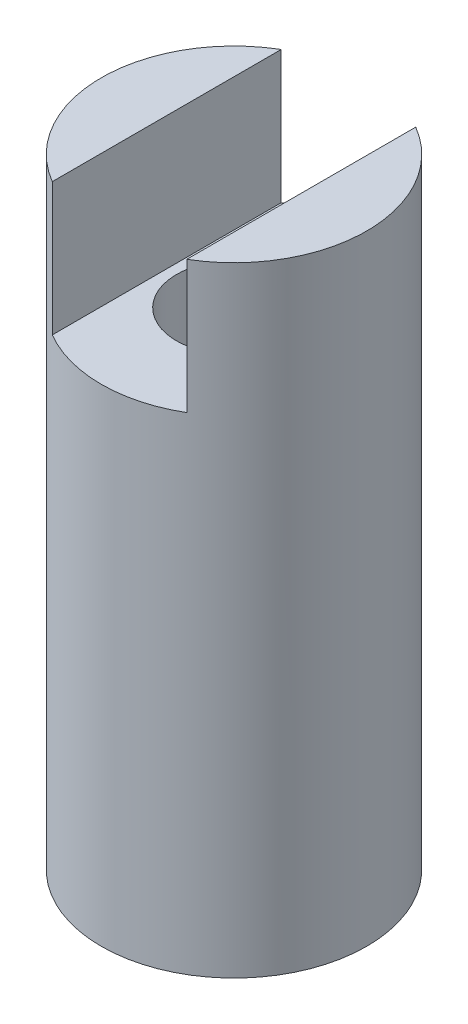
ISO-10303-21;
HEADER;
FILE_DESCRIPTION(('STEP AP214'),'2;1');
FILE_NAME('part.step','',(''),(''),'','','');
FILE_SCHEMA(('AUTOMOTIVE_DESIGN { 1 0 10303 214 1 1 1 1 }'));
ENDSEC;
DATA;
#1=APPLICATION_CONTEXT('core data for automotive mechanical design processes');
#2=APPLICATION_PROTOCOL_DEFINITION('international standard','automotive_design',2000,#1);
#3=PRODUCT_CONTEXT('',#1,'mechanical');
#4=PRODUCT('Part','Part','',(#3));
#5=PRODUCT_RELATED_PRODUCT_CATEGORY('part','',(#4));
#6=PRODUCT_DEFINITION_FORMATION('','',#4);
#7=PRODUCT_DEFINITION_CONTEXT('part definition',#1,'design');
#8=PRODUCT_DEFINITION('design','',#6,#7);
#9=PRODUCT_DEFINITION_SHAPE('','',#8);
#10=(LENGTH_UNIT() NAMED_UNIT(*) SI_UNIT(.MILLI.,.METRE.));
#11=(NAMED_UNIT(*) PLANE_ANGLE_UNIT() SI_UNIT($,.RADIAN.));
#12=(NAMED_UNIT(*) SI_UNIT($,.STERADIAN.) SOLID_ANGLE_UNIT());
#13=UNCERTAINTY_MEASURE_WITH_UNIT(LENGTH_MEASURE(1.E-05),#10,'distance_accuracy_value','');
#14=(GEOMETRIC_REPRESENTATION_CONTEXT(3) GLOBAL_UNCERTAINTY_ASSIGNED_CONTEXT((#13)) GLOBAL_UNIT_ASSIGNED_CONTEXT((#10,
#11,#12)) REPRESENTATION_CONTEXT('',''));
#15=CARTESIAN_POINT('',(0.,0.,0.));
#16=DIRECTION('',(0.,0.,1.));
#17=DIRECTION('',(1.,0.,0.));
#18=AXIS2_PLACEMENT_3D('',#15,#16,#17);
#19=CARTESIAN_POINT('',(-15.,70.0000000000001,-1.66533453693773E-13));
#20=DIRECTION('',(0.,-1.,0.));
#21=DIRECTION('',(0.,0.,-1.));
#22=AXIS2_PLACEMENT_3D('',#19,#20,#21);
#23=PLANE('',#22);
#24=DIRECTION('',(0.,0.,-1.));
#25=VECTOR('',#24,1.);
#26=CARTESIAN_POINT('',(7.59999999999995,70.0000000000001,0.));
#27=LINE('',#26,#25);
#28=CARTESIAN_POINT('',(7.59999999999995,70.0000000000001,12.9321305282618));
#29=VERTEX_POINT('',#28);
#30=CARTESIAN_POINT('',(7.59999999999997,70.0000000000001,-12.9321305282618));
#31=VERTEX_POINT('',#30);
#32=EDGE_CURVE('E49',#29,#31,#27,.T.);
#33=ORIENTED_EDGE('',*,*,#32,.F.);
#34=CARTESIAN_POINT('',(0.,70.0000000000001,-1.66533453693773E-13));
#35=DIRECTION('',(0.,-1.,0.));
#36=DIRECTION('',(0.,0.,-1.));
#37=AXIS2_PLACEMENT_3D('',#34,#35,#36);
#38=CIRCLE('',#37,15.);
#39=EDGE_CURVE('E102',#31,#29,#38,.T.);
#40=ORIENTED_EDGE('',*,*,#39,.F.);
#41=EDGE_LOOP('',(#33,#40));
#42=FACE_BOUND('',#41,.T.);
#43=ADVANCED_FACE('F40',(#42),#23,.F.);
#44=CARTESIAN_POINT('',(0.,0.,-1.66533453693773E-13));
#45=DIRECTION('',(0.,-1.,0.));
#46=DIRECTION('',(0.,0.,-1.));
#47=AXIS2_PLACEMENT_3D('',#44,#45,#46);
#48=CYLINDRICAL_SURFACE('',#47,15.);
#49=CARTESIAN_POINT('',(0.,0.,-1.66533453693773E-13));
#50=DIRECTION('',(0.,-1.,0.));
#51=DIRECTION('',(0.,0.,-1.));
#52=AXIS2_PLACEMENT_3D('',#49,#50,#51);
#53=CIRCLE('',#52,15.);
#54=CARTESIAN_POINT('',(0.,0.,-15.0000000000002));
#55=VERTEX_POINT('',#54);
#56=EDGE_CURVE('E115',#55,#55,#53,.T.);
#57=ORIENTED_EDGE('',*,*,#56,.F.);
#58=EDGE_LOOP('',(#57));
#59=FACE_BOUND('',#58,.T.);
#60=CARTESIAN_POINT('',(-7.60000000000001,70.0000000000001,12.9321305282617));
#61=VERTEX_POINT('',#60);
#62=CARTESIAN_POINT('',(-7.60000000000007,70.0000000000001,-12.9321305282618));
#63=VERTEX_POINT('',#62);
#64=EDGE_CURVE('E130',#61,#63,#38,.T.);
#65=ORIENTED_EDGE('',*,*,#64,.T.);
#66=DIRECTION('',(0.,-1.,0.));
#67=VECTOR('',#66,1.);
#68=CARTESIAN_POINT('',(-7.60000000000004,0.,-12.9321305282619));
#69=LINE('',#68,#67);
#70=CARTESIAN_POINT('',(-7.60000000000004,54.9999999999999,-12.9321305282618));
#71=VERTEX_POINT('',#70);
#72=EDGE_CURVE('E64',#63,#71,#69,.T.);
#73=ORIENTED_EDGE('',*,*,#72,.T.);
#74=CARTESIAN_POINT('',(0.,54.9999999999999,-1.66533453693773E-13));
#75=DIRECTION('',(0.,-1.,0.));
#76=DIRECTION('',(0.,0.,-1.));
#77=AXIS2_PLACEMENT_3D('',#74,#75,#76);
#78=CIRCLE('',#77,15.);
#79=CARTESIAN_POINT('',(7.59999999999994,54.9999999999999,-12.9321305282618));
#80=VERTEX_POINT('',#79);
#81=EDGE_CURVE('E92',#71,#80,#78,.T.);
#82=ORIENTED_EDGE('',*,*,#81,.T.);
#83=DIRECTION('',(0.,-1.,0.));
#84=VECTOR('',#83,1.);
#85=CARTESIAN_POINT('',(7.59999999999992,0.,-12.9321305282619));
#86=LINE('',#85,#84);
#87=EDGE_CURVE('E96',#31,#80,#86,.T.);
#88=ORIENTED_EDGE('',*,*,#87,.F.);
#89=ORIENTED_EDGE('',*,*,#39,.T.);
#90=DIRECTION('',(0.,-1.,0.));
#91=VECTOR('',#90,1.);
#92=CARTESIAN_POINT('',(7.59999999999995,0.,12.9321305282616));
#93=LINE('',#92,#91);
#94=CARTESIAN_POINT('',(7.59999999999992,54.9999999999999,12.9321305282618));
#95=VERTEX_POINT('',#94);
#96=EDGE_CURVE('E56',#95,#29,#93,.F.);
#97=ORIENTED_EDGE('',*,*,#96,.F.);
#98=CARTESIAN_POINT('',(-7.60000000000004,54.9999999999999,12.9321305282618));
#99=VERTEX_POINT('',#98);
#100=EDGE_CURVE('E84',#95,#99,#78,.T.);
#101=ORIENTED_EDGE('',*,*,#100,.T.);
#102=DIRECTION('',(0.,-1.,0.));
#103=VECTOR('',#102,1.);
#104=CARTESIAN_POINT('',(-7.60000000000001,0.,12.9321305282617));
#105=LINE('',#104,#103);
#106=EDGE_CURVE('E108',#99,#61,#105,.F.);
#107=ORIENTED_EDGE('',*,*,#106,.T.);
#108=EDGE_LOOP('',(#65,#73,#82,#88,#89,#97,#101,#107));
#109=FACE_BOUND('',#108,.T.);
#110=ADVANCED_FACE('F42',(#59,#109),#48,.T.);
#111=ORIENTED_EDGE('',*,*,#64,.F.);
#112=DIRECTION('',(0.,0.,-1.));
#113=VECTOR('',#112,1.);
#114=CARTESIAN_POINT('',(-7.60000000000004,70.0000000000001,0.));
#115=LINE('',#114,#113);
#116=EDGE_CURVE('E11',#61,#63,#115,.T.);
#117=ORIENTED_EDGE('',*,*,#116,.T.);
#118=EDGE_LOOP('',(#111,#117));
#119=FACE_BOUND('',#118,.T.);
#120=ADVANCED_FACE('F139',(#119),#23,.F.);
#121=CARTESIAN_POINT('',(0.,0.,-1.66533453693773E-13));
#122=DIRECTION('',(0.,-1.,0.));
#123=DIRECTION('',(0.,0.,-1.));
#124=AXIS2_PLACEMENT_3D('',#121,#122,#123);
#125=CYLINDRICAL_SURFACE('',#124,6.5);
#126=CARTESIAN_POINT('',(0.,54.9999999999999,-1.66533453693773E-13));
#127=DIRECTION('',(0.,-1.,0.));
#128=DIRECTION('',(0.,0.,-1.));
#129=AXIS2_PLACEMENT_3D('',#126,#127,#128);
#130=CIRCLE('',#129,6.5);
#131=CARTESIAN_POINT('',(0.,54.9999999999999,-6.50000000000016));
#132=VERTEX_POINT('',#131);
#133=EDGE_CURVE('E133',#132,#132,#130,.F.);
#134=ORIENTED_EDGE('',*,*,#133,.T.);
#135=EDGE_LOOP('',(#134));
#136=FACE_BOUND('',#135,.T.);
#137=CARTESIAN_POINT('',(0.,44.9999999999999,-4.02455846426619E-13));
#138=DIRECTION('',(0.,-1.,0.));
#139=DIRECTION('',(0.,0.,-1.));
#140=AXIS2_PLACEMENT_3D('',#137,#138,#139);
#141=CIRCLE('',#140,6.5);
#142=CARTESIAN_POINT('',(0.,44.9999999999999,-6.5000000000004));
#143=VERTEX_POINT('',#142);
#144=EDGE_CURVE('E127',#143,#143,#141,.T.);
#145=ORIENTED_EDGE('',*,*,#144,.T.);
#146=EDGE_LOOP('',(#145));
#147=FACE_BOUND('',#146,.T.);
#148=ADVANCED_FACE('F146',(#136,#147),#125,.F.);
#149=CARTESIAN_POINT('',(0.,41.75,0.));
#150=DIRECTION('',(0.,1.,0.));
#151=DIRECTION('',(0.,0.,1.));
#152=AXIS2_PLACEMENT_3D('',#149,#150,#151);
#153=CONICAL_SURFACE('',#152,3.25,0.78539816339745);
#154=ORIENTED_EDGE('',*,*,#144,.F.);
#155=EDGE_LOOP('',(#154));
#156=FACE_BOUND('',#155,.T.);
#157=CARTESIAN_POINT('',(0.,41.75,0.));
#158=DIRECTION('',(0.,-1.,0.));
#159=DIRECTION('',(0.,0.,-1.));
#160=AXIS2_PLACEMENT_3D('',#157,#158,#159);
#161=CIRCLE('',#160,3.25);
#162=CARTESIAN_POINT('',(0.,41.75,-3.25));
#163=VERTEX_POINT('',#162);
#164=EDGE_CURVE('E123',#163,#163,#161,.T.);
#165=ORIENTED_EDGE('',*,*,#164,.T.);
#166=EDGE_LOOP('',(#165));
#167=FACE_BOUND('',#166,.T.);
#168=ADVANCED_FACE('F151',(#156,#167),#153,.F.);
#169=CARTESIAN_POINT('',(0.,0.,-1.66533453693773E-13));
#170=DIRECTION('',(0.,-1.,0.));
#171=DIRECTION('',(0.,0.,-1.));
#172=AXIS2_PLACEMENT_3D('',#169,#170,#171);
#173=CYLINDRICAL_SURFACE('',#172,3.25);
#174=ORIENTED_EDGE('',*,*,#164,.F.);
#175=EDGE_LOOP('',(#174));
#176=FACE_BOUND('',#175,.T.);
#177=CARTESIAN_POINT('',(0.,0.,-1.66533453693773E-13));
#178=DIRECTION('',(0.,-1.,0.));
#179=DIRECTION('',(0.,0.,-1.));
#180=AXIS2_PLACEMENT_3D('',#177,#178,#179);
#181=CIRCLE('',#180,3.25);
#182=CARTESIAN_POINT('',(0.,0.,-3.25000000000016));
#183=VERTEX_POINT('',#182);
#184=EDGE_CURVE('E119',#183,#183,#181,.T.);
#185=ORIENTED_EDGE('',*,*,#184,.T.);
#186=EDGE_LOOP('',(#185));
#187=FACE_BOUND('',#186,.T.);
#188=ADVANCED_FACE('F165',(#176,#187),#173,.F.);
#189=CARTESIAN_POINT('',(-3.25000000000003,0.,0.));
#190=DIRECTION('',(0.,1.,0.));
#191=DIRECTION('',(0.,0.,1.));
#192=AXIS2_PLACEMENT_3D('',#189,#190,#191);
#193=PLANE('',#192);
#194=ORIENTED_EDGE('',*,*,#184,.F.);
#195=EDGE_LOOP('',(#194));
#196=FACE_BOUND('',#195,.T.);
#197=ORIENTED_EDGE('',*,*,#56,.T.);
#198=EDGE_LOOP('',(#197));
#199=FACE_BOUND('',#198,.T.);
#200=ADVANCED_FACE('F158',(#196,#199),#193,.F.);
#201=CARTESIAN_POINT('',(-7.60000000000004,85.,24.9999999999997));
#202=DIRECTION('',(-1.,0.,0.));
#203=DIRECTION('',(0.,0.,1.));
#204=AXIS2_PLACEMENT_3D('',#201,#202,#203);
#205=PLANE('',#204);
#206=ORIENTED_EDGE('',*,*,#116,.F.);
#207=ORIENTED_EDGE('',*,*,#106,.F.);
#208=DIRECTION('',(0.,0.,-1.));
#209=VECTOR('',#208,1.);
#210=CARTESIAN_POINT('',(-7.60000000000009,54.9999999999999,24.9999999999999));
#211=LINE('',#210,#209);
#212=EDGE_CURVE('E88',#99,#71,#211,.T.);
#213=ORIENTED_EDGE('',*,*,#212,.T.);
#214=ORIENTED_EDGE('',*,*,#72,.F.);
#215=EDGE_LOOP('',(#206,#207,#213,#214));
#216=FACE_BOUND('',#215,.T.);
#217=ADVANCED_FACE('F156',(#216),#205,.F.);
#218=CARTESIAN_POINT('',(7.59999999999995,85.0000000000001,24.9999999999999));
#219=DIRECTION('',(-1.,0.,0.));
#220=DIRECTION('',(0.,0.,1.));
#221=AXIS2_PLACEMENT_3D('',#218,#219,#220);
#222=PLANE('',#221);
#223=ORIENTED_EDGE('',*,*,#87,.T.);
#224=DIRECTION('',(0.,0.,-1.));
#225=VECTOR('',#224,1.);
#226=CARTESIAN_POINT('',(7.59999999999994,54.9999999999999,25.));
#227=LINE('',#226,#225);
#228=EDGE_CURVE('E86',#95,#80,#227,.T.);
#229=ORIENTED_EDGE('',*,*,#228,.F.);
#230=ORIENTED_EDGE('',*,*,#96,.T.);
#231=ORIENTED_EDGE('',*,*,#32,.T.);
#232=EDGE_LOOP('',(#223,#229,#230,#231));
#233=FACE_BOUND('',#232,.T.);
#234=ADVANCED_FACE('F94',(#233),#222,.T.);
#235=CARTESIAN_POINT('',(-7.60000000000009,54.9999999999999,24.9999999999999));
#236=DIRECTION('',(0.,-1.,0.));
#237=DIRECTION('',(0.,0.,-1.));
#238=AXIS2_PLACEMENT_3D('',#235,#236,#237);
#239=PLANE('',#238);
#240=ORIENTED_EDGE('',*,*,#133,.F.);
#241=EDGE_LOOP('',(#240));
#242=FACE_BOUND('',#241,.T.);
#243=ORIENTED_EDGE('',*,*,#228,.T.);
#244=ORIENTED_EDGE('',*,*,#81,.F.);
#245=ORIENTED_EDGE('',*,*,#212,.F.);
#246=ORIENTED_EDGE('',*,*,#100,.F.);
#247=EDGE_LOOP('',(#243,#244,#245,#246));
#248=FACE_BOUND('',#247,.T.);
#249=ADVANCED_FACE('F85',(#242,#248),#239,.F.);
#250=CLOSED_SHELL('',(#43,#110,#120,#148,#168,#188,#200,#217,#234,#249));
#251=MANIFOLD_SOLID_BREP('B2',#250);
#252=ADVANCED_BREP_SHAPE_REPRESENTATION('',(#18,#251),#14);
#253=SHAPE_DEFINITION_REPRESENTATION(#9,#252);
ENDSEC;
END-ISO-10303-21;
